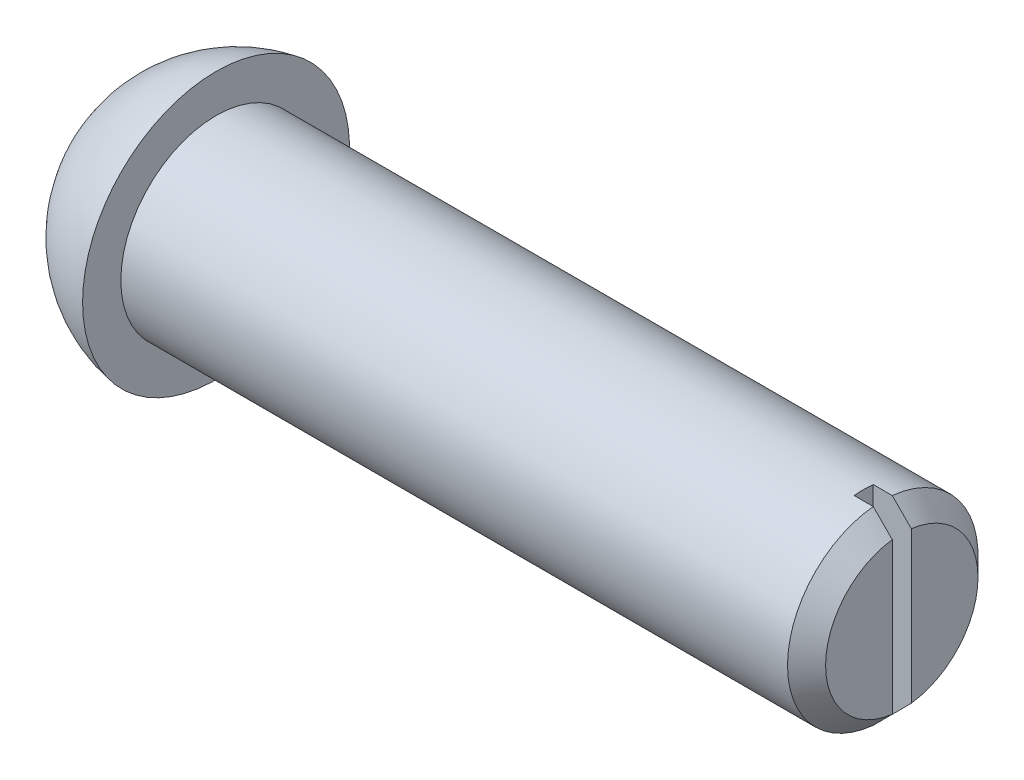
from build123d import *

# Parameters (mm, degrees)
CHANFREIN1_SIZE         = 0.5
ESQUISSE2_W             = 0.5
ESQUISSE2_H             = 5.570617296
ENL_V_MAT_EXTRU_1_DEPTH = 1


with BuildPart() as part:
    # Esquisse1 → R_volution1 (revolve)
    with BuildSketch(Plane.XY, mode=Mode.PRIVATE) as r_volution1_sk:
        with BuildLine():
            Line((-45.607860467, 0.005935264), (-45.607860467, -0.997723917))
            ThreePointArc((-45.607860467, -0.997723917), (-47.75539036, 0.199659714), (-48.607860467, 2.505935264))
            Line((-48.607860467, 2.505935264), (-27.607860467, 2.505935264))
            Line((-27.607860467, 2.505935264), (-27.607860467, 0.005935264))
            Line((-27.607860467, 0.005935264), (-45.607860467, 0.005935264))
        make_face()
    revolve(r_volution1_sk.sketch.rotate(Axis((-48.607860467, 2.505935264, 0), (1, 0, 0)), 180), axis=Axis((-48.607860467, 2.505935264, 0), (1, 0, 0)))

    # Chanfrein1
    chanfrein1_edges = [part.edges().sort_by_distance(p)[0] for p in [
        (-27.607860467, 0.005935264, 0),
    ]]
    chamfer(chanfrein1_edges, length=CHANFREIN1_SIZE)

    # Esquisse2 → Enl_v. mat.-Extru.1 (cut)
    with BuildSketch(Plane(origin=(-27.607860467, 0, 0), x_dir=(0, 0, -1), z_dir=(1, 0, 0))):
        with Locations((0, 2.59014227)):
            Rectangle(ESQUISSE2_W, ESQUISSE2_H)
    extrude(amount=-ENL_V_MAT_EXTRU_1_DEPTH, mode=Mode.SUBTRACT)


solid = part.part
